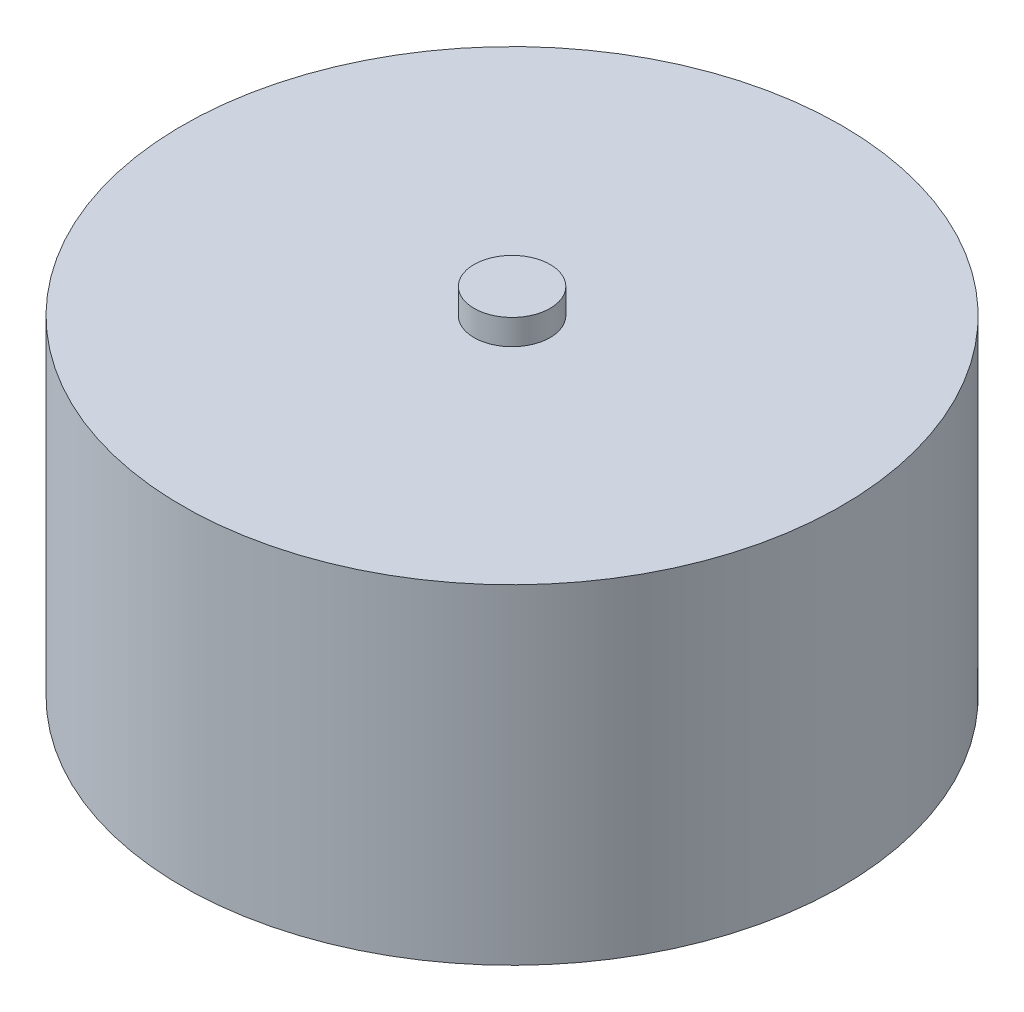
from build123d import *

# Parameters (mm, degrees)
SKETCH1_R           = 6.5
BOSS_EXTRUDE1_DEPTH = 6.5
SKETCH2_R           = 0.75
BOSS_EXTRUDE2_DEPTH = 0.5


with BuildPart() as part:
    # Sketch1 → Boss-Extrude1 (new body)
    with BuildSketch(Plane(origin=(0, 0, 0), x_dir=(1, 0, 0), z_dir=(0, 1, 0))):
        with Locations(Location((0, 0, 0), (0, 0, 90))):
            Circle(SKETCH1_R)
    extrude(amount=BOSS_EXTRUDE1_DEPTH)

    # Sketch2 → Boss-Extrude2 (add)
    with BuildSketch(Plane(origin=(0, 6.5, 0), x_dir=(1, 0, 0), z_dir=(0, 1, 0))):
        with Locations(Location((0, 0, 0), (0, 0, 270))):
            Circle(SKETCH2_R)
    extrude(amount=BOSS_EXTRUDE2_DEPTH)


solid = part.part
